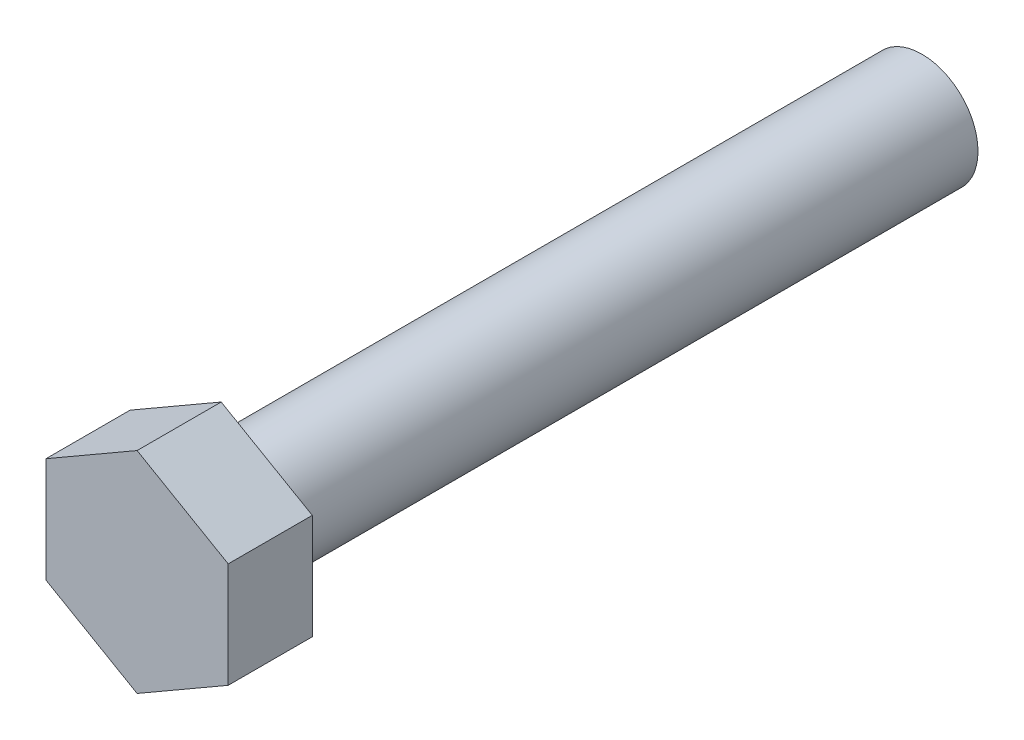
from build123d import *

# Parameters (mm, degrees)
BOSS_EXTRUDE1_DEPTH = 12
SKETCH2_R           = 8
BOSS_EXTRUDE2_DEPTH = 100


with BuildPart() as part:
    # Sketch1 → Boss-Extrude1 (new body)
    with BuildSketch(Plane.XY):
        Polygon((13, 7.505553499), (0, 15.011106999), (-13, 7.505553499), (-13, -7.505553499), (0, -15.011106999), (13, -7.505553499), align=None)
    extrude(amount=BOSS_EXTRUDE1_DEPTH)

    # Sketch2 → Boss-Extrude2 (add)
    with BuildSketch(Plane(origin=(0, 0, 0), x_dir=(-1, 0, 0), z_dir=(0, 0, -1))):
        with Locations(Location((0, 0, 0), (0, 0, 180))):
            Circle(SKETCH2_R)
    extrude(amount=BOSS_EXTRUDE2_DEPTH)


solid = part.part
